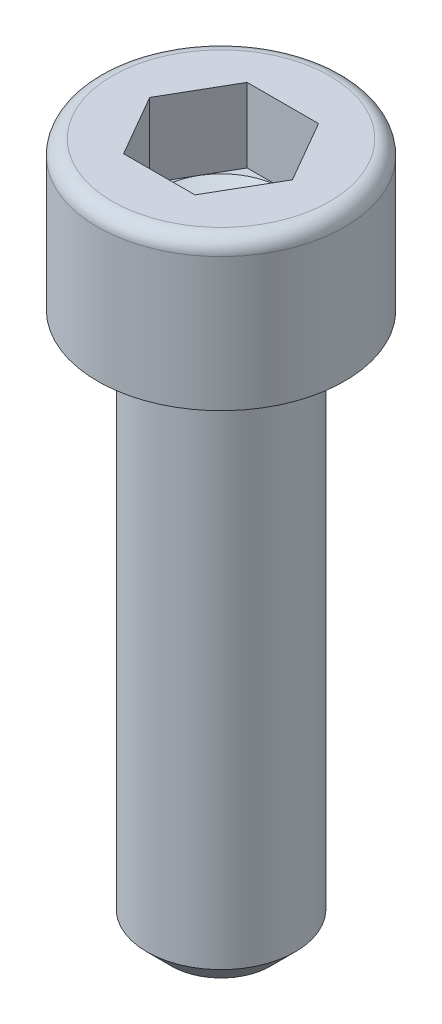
ISO-10303-21;
HEADER;
FILE_DESCRIPTION(('STEP AP214'),'2;1');
FILE_NAME('part.step','',(''),(''),'','','');
FILE_SCHEMA(('AUTOMOTIVE_DESIGN { 1 0 10303 214 1 1 1 1 }'));
ENDSEC;
DATA;
#1=APPLICATION_CONTEXT('core data for automotive mechanical design processes');
#2=APPLICATION_PROTOCOL_DEFINITION('international standard','automotive_design',2000,#1);
#3=PRODUCT_CONTEXT('',#1,'mechanical');
#4=PRODUCT('Part','Part','',(#3));
#5=PRODUCT_RELATED_PRODUCT_CATEGORY('part','',(#4));
#6=PRODUCT_DEFINITION_FORMATION('','',#4);
#7=PRODUCT_DEFINITION_CONTEXT('part definition',#1,'design');
#8=PRODUCT_DEFINITION('design','',#6,#7);
#9=PRODUCT_DEFINITION_SHAPE('','',#8);
#10=(LENGTH_UNIT() NAMED_UNIT(*) SI_UNIT(.MILLI.,.METRE.));
#11=(NAMED_UNIT(*) PLANE_ANGLE_UNIT() SI_UNIT($,.RADIAN.));
#12=(NAMED_UNIT(*) SI_UNIT($,.STERADIAN.) SOLID_ANGLE_UNIT());
#13=UNCERTAINTY_MEASURE_WITH_UNIT(LENGTH_MEASURE(1.E-05),#10,'distance_accuracy_value','');
#14=(GEOMETRIC_REPRESENTATION_CONTEXT(3) GLOBAL_UNCERTAINTY_ASSIGNED_CONTEXT((#13)) GLOBAL_UNIT_ASSIGNED_CONTEXT((#10,
#11,#12)) REPRESENTATION_CONTEXT('',''));
#15=CARTESIAN_POINT('',(0.,0.,0.));
#16=DIRECTION('',(0.,0.,1.));
#17=DIRECTION('',(1.,0.,0.));
#18=AXIS2_PLACEMENT_3D('',#15,#16,#17);
#19=CARTESIAN_POINT('',(-4.33012701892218,3.,2.5));
#20=DIRECTION('',(0.,-1.,0.));
#21=DIRECTION('',(0.,0.,-1.));
#22=AXIS2_PLACEMENT_3D('',#19,#20,#21);
#23=PLANE('',#22);
#24=DIRECTION('',(-0.499999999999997,0.,0.86602540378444));
#25=VECTOR('',#24,1.);
#26=CARTESIAN_POINT('',(2.1650635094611,3.,1.24999999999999));
#27=LINE('',#26,#25);
#28=CARTESIAN_POINT('',(2.16506350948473,2.99999999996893,1.25000000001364));
#29=VERTEX_POINT('',#28);
#30=CARTESIAN_POINT('',(1.44337567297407,3.,2.5));
#31=VERTEX_POINT('',#30);
#32=EDGE_CURVE('E102',#29,#31,#27,.T.);
#33=ORIENTED_EDGE('',*,*,#32,.F.);
#34=CARTESIAN_POINT('',(0.,2.99999999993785,0.));
#35=DIRECTION('',(0.,1.,0.));
#36=DIRECTION('',(0.,0.,1.));
#37=AXIS2_PLACEMENT_3D('',#34,#35,#36);
#38=CIRCLE('',#37,2.50000000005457);
#39=CARTESIAN_POINT('',(0.,2.99999999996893,2.50000000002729));
#40=VERTEX_POINT('',#39);
#41=EDGE_CURVE('E110',#29,#40,#38,.F.);
#42=ORIENTED_EDGE('',*,*,#41,.T.);
#43=DIRECTION('',(1.,0.,0.));
#44=VECTOR('',#43,1.);
#45=CARTESIAN_POINT('',(-4.33012701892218,3.,2.5));
#46=LINE('',#45,#44);
#47=EDGE_CURVE('E79',#31,#40,#46,.F.);
#48=ORIENTED_EDGE('',*,*,#47,.F.);
#49=EDGE_LOOP('',(#33,#42,#48));
#50=FACE_BOUND('',#49,.T.);
#51=ADVANCED_FACE('F16',(#50),#23,.F.);
#52=CARTESIAN_POINT('',(-4.33012701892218,3.,2.5));
#53=DIRECTION('',(0.,-1.,0.));
#54=DIRECTION('',(0.,0.,-1.));
#55=AXIS2_PLACEMENT_3D('',#52,#53,#54);
#56=PLANE('',#55);
#57=DIRECTION('',(1.,0.,0.));
#58=VECTOR('',#57,1.);
#59=CARTESIAN_POINT('',(-4.33012701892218,3.,2.5));
#60=LINE('',#59,#58);
#61=CARTESIAN_POINT('',(-1.44337567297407,3.,2.5));
#62=VERTEX_POINT('',#61);
#63=EDGE_CURVE('E261',#40,#62,#60,.F.);
#64=ORIENTED_EDGE('',*,*,#63,.F.);
#65=CARTESIAN_POINT('',(0.,2.99999999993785,0.));
#66=DIRECTION('',(0.,1.,0.));
#67=DIRECTION('',(0.,0.,1.));
#68=AXIS2_PLACEMENT_3D('',#65,#66,#67);
#69=CIRCLE('',#68,2.50000000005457);
#70=CARTESIAN_POINT('',(-2.16506350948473,2.99999999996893,1.25000000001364));
#71=VERTEX_POINT('',#70);
#72=EDGE_CURVE('E116',#40,#71,#69,.F.);
#73=ORIENTED_EDGE('',*,*,#72,.T.);
#74=DIRECTION('',(-0.499999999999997,0.,-0.86602540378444));
#75=VECTOR('',#74,1.);
#76=CARTESIAN_POINT('',(-1.44337567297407,3.,2.5));
#77=LINE('',#76,#75);
#78=EDGE_CURVE('E259',#62,#71,#77,.T.);
#79=ORIENTED_EDGE('',*,*,#78,.F.);
#80=EDGE_LOOP('',(#64,#73,#79));
#81=FACE_BOUND('',#80,.T.);
#82=ADVANCED_FACE('F263',(#81),#56,.F.);
#83=CARTESIAN_POINT('',(-4.33012701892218,3.,2.5));
#84=DIRECTION('',(0.,-1.,0.));
#85=DIRECTION('',(0.,0.,-1.));
#86=AXIS2_PLACEMENT_3D('',#83,#84,#85);
#87=PLANE('',#86);
#88=DIRECTION('',(1.,0.,0.));
#89=VECTOR('',#88,1.);
#90=CARTESIAN_POINT('',(-4.33012701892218,3.,-2.5));
#91=LINE('',#90,#89);
#92=CARTESIAN_POINT('',(0.,2.99999999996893,-2.50000000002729));
#93=VERTEX_POINT('',#92);
#94=CARTESIAN_POINT('',(1.44337567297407,3.,-2.5));
#95=VERTEX_POINT('',#94);
#96=EDGE_CURVE('E121',#93,#95,#91,.T.);
#97=ORIENTED_EDGE('',*,*,#96,.F.);
#98=CARTESIAN_POINT('',(0.,2.99999999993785,0.));
#99=DIRECTION('',(0.,1.,0.));
#100=DIRECTION('',(0.,0.,1.));
#101=AXIS2_PLACEMENT_3D('',#98,#99,#100);
#102=CIRCLE('',#101,2.50000000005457);
#103=CARTESIAN_POINT('',(2.16506350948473,2.99999999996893,-1.25000000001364));
#104=VERTEX_POINT('',#103);
#105=EDGE_CURVE('E96',#93,#104,#102,.F.);
#106=ORIENTED_EDGE('',*,*,#105,.T.);
#107=DIRECTION('',(0.499999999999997,0.,0.86602540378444));
#108=VECTOR('',#107,1.);
#109=CARTESIAN_POINT('',(1.44337567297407,3.,-2.5));
#110=LINE('',#109,#108);
#111=EDGE_CURVE('E117',#95,#104,#110,.T.);
#112=ORIENTED_EDGE('',*,*,#111,.F.);
#113=EDGE_LOOP('',(#97,#106,#112));
#114=FACE_BOUND('',#113,.T.);
#115=ADVANCED_FACE('F285',(#114),#87,.F.);
#116=CARTESIAN_POINT('',(0.,2.99999999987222,0.));
#117=DIRECTION('',(0.,1.,0.));
#118=DIRECTION('',(0.,0.,1.));
#119=AXIS2_PLACEMENT_3D('',#116,#117,#118);
#120=CONICAL_SURFACE('',#119,2.49999999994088,1.04719755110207);
#121=CARTESIAN_POINT('',(-7.105427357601E-11,1.55662432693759,0.));
#122=VERTEX_POINT('',#121);
#123=VERTEX_LOOP('',#122);
#124=FACE_BOUND('',#123,.T.);
#125=ORIENTED_EDGE('',*,*,#41,.F.);
#126=CARTESIAN_POINT('',(0.,2.99999999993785,0.));
#127=DIRECTION('',(0.,1.,0.));
#128=DIRECTION('',(0.,0.,1.));
#129=AXIS2_PLACEMENT_3D('',#126,#127,#128);
#130=CIRCLE('',#129,2.50000000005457);
#131=EDGE_CURVE('E85',#104,#29,#130,.F.);
#132=ORIENTED_EDGE('',*,*,#131,.F.);
#133=ORIENTED_EDGE('',*,*,#105,.F.);
#134=CARTESIAN_POINT('',(0.,2.99999999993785,0.));
#135=DIRECTION('',(0.,1.,0.));
#136=DIRECTION('',(0.,0.,1.));
#137=AXIS2_PLACEMENT_3D('',#134,#135,#136);
#138=CIRCLE('',#137,2.50000000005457);
#139=CARTESIAN_POINT('',(-2.16506350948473,2.99999999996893,-1.25000000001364));
#140=VERTEX_POINT('',#139);
#141=EDGE_CURVE('E95',#93,#140,#138,.T.);
#142=ORIENTED_EDGE('',*,*,#141,.T.);
#143=CARTESIAN_POINT('',(0.,2.99999999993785,0.));
#144=DIRECTION('',(0.,1.,0.));
#145=DIRECTION('',(0.,0.,1.));
#146=AXIS2_PLACEMENT_3D('',#143,#144,#145);
#147=CIRCLE('',#146,2.50000000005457);
#148=EDGE_CURVE('E119',#71,#140,#147,.F.);
#149=ORIENTED_EDGE('',*,*,#148,.F.);
#150=ORIENTED_EDGE('',*,*,#72,.F.);
#151=EDGE_LOOP('',(#125,#132,#133,#142,#149,#150));
#152=FACE_BOUND('',#151,.T.);
#153=ADVANCED_FACE('F114',(#124,#152),#120,.F.);
#154=CARTESIAN_POINT('',(-4.33012701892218,3.,2.5));
#155=DIRECTION('',(0.,-1.,0.));
#156=DIRECTION('',(0.,0.,-1.));
#157=AXIS2_PLACEMENT_3D('',#154,#155,#156);
#158=PLANE('',#157);
#159=DIRECTION('',(0.499999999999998,0.,-0.86602540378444));
#160=VECTOR('',#159,1.);
#161=CARTESIAN_POINT('',(-1.44337567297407,3.,-2.5));
#162=LINE('',#161,#160);
#163=CARTESIAN_POINT('',(-1.44337567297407,3.,-2.5));
#164=VERTEX_POINT('',#163);
#165=EDGE_CURVE('E203',#140,#164,#162,.T.);
#166=ORIENTED_EDGE('',*,*,#165,.F.);
#167=ORIENTED_EDGE('',*,*,#141,.F.);
#168=DIRECTION('',(1.,0.,0.));
#169=VECTOR('',#168,1.);
#170=CARTESIAN_POINT('',(1.44337567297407,3.,-2.5));
#171=LINE('',#170,#169);
#172=EDGE_CURVE('E204',#164,#93,#171,.T.);
#173=ORIENTED_EDGE('',*,*,#172,.F.);
#174=EDGE_LOOP('',(#166,#167,#173));
#175=FACE_BOUND('',#174,.T.);
#176=ADVANCED_FACE('F245',(#175),#158,.F.);
#177=CARTESIAN_POINT('',(-4.33012701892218,3.,2.5));
#178=DIRECTION('',(0.,-1.,0.));
#179=DIRECTION('',(0.,0.,-1.));
#180=AXIS2_PLACEMENT_3D('',#177,#178,#179);
#181=PLANE('',#180);
#182=DIRECTION('',(-0.499999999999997,0.,-0.86602540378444));
#183=VECTOR('',#182,1.);
#184=CARTESIAN_POINT('',(-1.44337567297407,3.,2.5));
#185=LINE('',#184,#183);
#186=CARTESIAN_POINT('',(-2.88675134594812,3.,0.));
#187=VERTEX_POINT('',#186);
#188=EDGE_CURVE('E189',#71,#187,#185,.T.);
#189=ORIENTED_EDGE('',*,*,#188,.F.);
#190=ORIENTED_EDGE('',*,*,#148,.T.);
#191=DIRECTION('',(0.499999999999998,0.,-0.86602540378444));
#192=VECTOR('',#191,1.);
#193=CARTESIAN_POINT('',(-1.44337567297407,3.,-2.5));
#194=LINE('',#193,#192);
#195=EDGE_CURVE('E200',#187,#140,#194,.T.);
#196=ORIENTED_EDGE('',*,*,#195,.F.);
#197=EDGE_LOOP('',(#189,#190,#196));
#198=FACE_BOUND('',#197,.T.);
#199=ADVANCED_FACE('F239',(#198),#181,.F.);
#200=CARTESIAN_POINT('',(-4.33012701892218,3.,2.5));
#201=DIRECTION('',(0.,-1.,0.));
#202=DIRECTION('',(0.,0.,-1.));
#203=AXIS2_PLACEMENT_3D('',#200,#201,#202);
#204=PLANE('',#203);
#205=DIRECTION('',(0.499999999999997,0.,0.86602540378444));
#206=VECTOR('',#205,1.);
#207=CARTESIAN_POINT('',(1.44337567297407,3.,-2.5));
#208=LINE('',#207,#206);
#209=CARTESIAN_POINT('',(2.88675134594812,3.,0.));
#210=VERTEX_POINT('',#209);
#211=EDGE_CURVE('E91',#104,#210,#208,.T.);
#212=ORIENTED_EDGE('',*,*,#211,.F.);
#213=ORIENTED_EDGE('',*,*,#131,.T.);
#214=DIRECTION('',(-0.499999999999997,0.,0.86602540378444));
#215=VECTOR('',#214,1.);
#216=CARTESIAN_POINT('',(1.44337567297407,3.,2.5));
#217=LINE('',#216,#215);
#218=EDGE_CURVE('E88',#210,#29,#217,.T.);
#219=ORIENTED_EDGE('',*,*,#218,.F.);
#220=EDGE_LOOP('',(#212,#213,#219));
#221=FACE_BOUND('',#220,.T.);
#222=ADVANCED_FACE('F87',(#221),#204,.F.);
#223=CARTESIAN_POINT('',(1.44337567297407,3.,-2.5));
#224=DIRECTION('',(0.,0.,1.));
#225=DIRECTION('',(1.,0.,0.));
#226=AXIS2_PLACEMENT_3D('',#223,#224,#225);
#227=PLANE('',#226);
#228=ORIENTED_EDGE('',*,*,#96,.T.);
#229=DIRECTION('',(0.,1.,0.));
#230=VECTOR('',#229,1.);
#231=CARTESIAN_POINT('',(1.44337567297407,3.,-2.5));
#232=LINE('',#231,#230);
#233=CARTESIAN_POINT('',(1.44337567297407,6.,-2.5));
#234=VERTEX_POINT('',#233);
#235=EDGE_CURVE('E181',#234,#95,#232,.F.);
#236=ORIENTED_EDGE('',*,*,#235,.F.);
#237=DIRECTION('',(1.,0.,0.));
#238=VECTOR('',#237,1.);
#239=CARTESIAN_POINT('',(2.5,6.,-2.5));
#240=LINE('',#239,#238);
#241=CARTESIAN_POINT('',(-1.44337567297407,6.,-2.5));
#242=VERTEX_POINT('',#241);
#243=EDGE_CURVE('E165',#234,#242,#240,.F.);
#244=ORIENTED_EDGE('',*,*,#243,.T.);
#245=DIRECTION('',(0.,1.,0.));
#246=VECTOR('',#245,1.);
#247=CARTESIAN_POINT('',(-1.44337567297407,3.,-2.5));
#248=LINE('',#247,#246);
#249=EDGE_CURVE('E193',#164,#242,#248,.T.);
#250=ORIENTED_EDGE('',*,*,#249,.F.);
#251=ORIENTED_EDGE('',*,*,#172,.T.);
#252=EDGE_LOOP('',(#228,#236,#244,#250,#251));
#253=FACE_BOUND('',#252,.T.);
#254=ADVANCED_FACE('F277',(#253),#227,.T.);
#255=CARTESIAN_POINT('',(-1.44337567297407,3.,-2.5));
#256=DIRECTION('',(0.86602540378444,0.,0.499999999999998));
#257=DIRECTION('',(0.499999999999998,0.,-0.86602540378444));
#258=AXIS2_PLACEMENT_3D('',#255,#256,#257);
#259=PLANE('',#258);
#260=ORIENTED_EDGE('',*,*,#165,.T.);
#261=ORIENTED_EDGE('',*,*,#249,.T.);
#262=DIRECTION('',(-0.499999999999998,0.,0.86602540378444));
#263=VECTOR('',#262,1.);
#264=CARTESIAN_POINT('',(-1.44337567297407,6.,-2.5));
#265=LINE('',#264,#263);
#266=CARTESIAN_POINT('',(-2.88675134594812,6.,0.));
#267=VERTEX_POINT('',#266);
#268=EDGE_CURVE('E252',#242,#267,#265,.T.);
#269=ORIENTED_EDGE('',*,*,#268,.T.);
#270=DIRECTION('',(0.,1.,0.));
#271=VECTOR('',#270,1.);
#272=CARTESIAN_POINT('',(-2.88675134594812,3.,0.));
#273=LINE('',#272,#271);
#274=EDGE_CURVE('E192',#187,#267,#273,.T.);
#275=ORIENTED_EDGE('',*,*,#274,.F.);
#276=ORIENTED_EDGE('',*,*,#195,.T.);
#277=EDGE_LOOP('',(#260,#261,#269,#275,#276));
#278=FACE_BOUND('',#277,.T.);
#279=ADVANCED_FACE('F248',(#278),#259,.T.);
#280=CARTESIAN_POINT('',(-1.44337567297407,3.,2.5));
#281=DIRECTION('',(0.86602540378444,0.,-0.499999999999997));
#282=DIRECTION('',(-0.499999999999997,0.,-0.86602540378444));
#283=AXIS2_PLACEMENT_3D('',#280,#281,#282);
#284=PLANE('',#283);
#285=ORIENTED_EDGE('',*,*,#188,.T.);
#286=ORIENTED_EDGE('',*,*,#274,.T.);
#287=DIRECTION('',(0.499999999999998,0.,0.86602540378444));
#288=VECTOR('',#287,1.);
#289=CARTESIAN_POINT('',(-2.88675134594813,6.,0.));
#290=LINE('',#289,#288);
#291=CARTESIAN_POINT('',(-1.44337567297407,6.,2.5));
#292=VERTEX_POINT('',#291);
#293=EDGE_CURVE('E434',#267,#292,#290,.T.);
#294=ORIENTED_EDGE('',*,*,#293,.T.);
#295=DIRECTION('',(0.,1.,0.));
#296=VECTOR('',#295,1.);
#297=CARTESIAN_POINT('',(-1.44337567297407,3.,2.5));
#298=LINE('',#297,#296);
#299=EDGE_CURVE('E107',#62,#292,#298,.T.);
#300=ORIENTED_EDGE('',*,*,#299,.F.);
#301=ORIENTED_EDGE('',*,*,#78,.T.);
#302=EDGE_LOOP('',(#285,#286,#294,#300,#301));
#303=FACE_BOUND('',#302,.T.);
#304=ADVANCED_FACE('F256',(#303),#284,.T.);
#305=CARTESIAN_POINT('',(1.44337567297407,3.,2.5));
#306=DIRECTION('',(0.,0.,-1.));
#307=DIRECTION('',(-1.,0.,0.));
#308=AXIS2_PLACEMENT_3D('',#305,#306,#307);
#309=PLANE('',#308);
#310=ORIENTED_EDGE('',*,*,#63,.T.);
#311=ORIENTED_EDGE('',*,*,#299,.T.);
#312=DIRECTION('',(1.,0.,0.));
#313=VECTOR('',#312,1.);
#314=CARTESIAN_POINT('',(2.5,6.,2.5));
#315=LINE('',#314,#313);
#316=CARTESIAN_POINT('',(1.44337567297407,6.,2.5));
#317=VERTEX_POINT('',#316);
#318=EDGE_CURVE('E435',#292,#317,#315,.T.);
#319=ORIENTED_EDGE('',*,*,#318,.T.);
#320=DIRECTION('',(0.,1.,0.));
#321=VECTOR('',#320,1.);
#322=CARTESIAN_POINT('',(1.44337567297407,3.,2.5));
#323=LINE('',#322,#321);
#324=EDGE_CURVE('E106',#31,#317,#323,.T.);
#325=ORIENTED_EDGE('',*,*,#324,.F.);
#326=ORIENTED_EDGE('',*,*,#47,.T.);
#327=EDGE_LOOP('',(#310,#311,#319,#325,#326));
#328=FACE_BOUND('',#327,.T.);
#329=ADVANCED_FACE('F362',(#328),#309,.T.);
#330=CARTESIAN_POINT('',(1.44337567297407,3.,2.5));
#331=DIRECTION('',(-0.86602540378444,0.,-0.499999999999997));
#332=DIRECTION('',(-0.499999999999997,0.,0.86602540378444));
#333=AXIS2_PLACEMENT_3D('',#330,#331,#332);
#334=PLANE('',#333);
#335=ORIENTED_EDGE('',*,*,#32,.T.);
#336=ORIENTED_EDGE('',*,*,#324,.T.);
#337=DIRECTION('',(0.499999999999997,0.,-0.86602540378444));
#338=VECTOR('',#337,1.);
#339=CARTESIAN_POINT('',(1.44337567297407,6.,2.5));
#340=LINE('',#339,#338);
#341=CARTESIAN_POINT('',(2.88675134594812,6.,0.));
#342=VERTEX_POINT('',#341);
#343=EDGE_CURVE('E438',#317,#342,#340,.T.);
#344=ORIENTED_EDGE('',*,*,#343,.T.);
#345=DIRECTION('',(0.,1.,0.));
#346=VECTOR('',#345,1.);
#347=CARTESIAN_POINT('',(2.88675134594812,3.,0.));
#348=LINE('',#347,#346);
#349=EDGE_CURVE('E105',#210,#342,#348,.T.);
#350=ORIENTED_EDGE('',*,*,#349,.F.);
#351=ORIENTED_EDGE('',*,*,#218,.T.);
#352=EDGE_LOOP('',(#335,#336,#344,#350,#351));
#353=FACE_BOUND('',#352,.T.);
#354=ADVANCED_FACE('F100',(#353),#334,.T.);
#355=CARTESIAN_POINT('',(1.44337567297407,3.,-2.5));
#356=DIRECTION('',(-0.86602540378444,0.,0.499999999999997));
#357=DIRECTION('',(0.499999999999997,0.,0.86602540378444));
#358=AXIS2_PLACEMENT_3D('',#355,#356,#357);
#359=PLANE('',#358);
#360=ORIENTED_EDGE('',*,*,#211,.T.);
#361=ORIENTED_EDGE('',*,*,#349,.T.);
#362=DIRECTION('',(-0.499999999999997,0.,-0.86602540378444));
#363=VECTOR('',#362,1.);
#364=CARTESIAN_POINT('',(2.88675134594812,6.,0.));
#365=LINE('',#364,#363);
#366=EDGE_CURVE('E129',#342,#234,#365,.T.);
#367=ORIENTED_EDGE('',*,*,#366,.T.);
#368=ORIENTED_EDGE('',*,*,#235,.T.);
#369=ORIENTED_EDGE('',*,*,#111,.T.);
#370=EDGE_LOOP('',(#360,#361,#367,#368,#369));
#371=FACE_BOUND('',#370,.T.);
#372=ADVANCED_FACE('F150',(#371),#359,.T.);
#373=CARTESIAN_POINT('',(2.5,6.,0.));
#374=DIRECTION('',(0.,-1.,0.));
#375=DIRECTION('',(1.,0.,0.));
#376=AXIS2_PLACEMENT_3D('',#373,#374,#375);
#377=PLANE('',#376);
#378=ORIENTED_EDGE('',*,*,#343,.F.);
#379=ORIENTED_EDGE('',*,*,#318,.F.);
#380=ORIENTED_EDGE('',*,*,#293,.F.);
#381=ORIENTED_EDGE('',*,*,#268,.F.);
#382=ORIENTED_EDGE('',*,*,#243,.F.);
#383=ORIENTED_EDGE('',*,*,#366,.F.);
#384=EDGE_LOOP('',(#378,#379,#380,#381,#382,#383));
#385=FACE_BOUND('',#384,.T.);
#386=CARTESIAN_POINT('',(0.,6.,0.));
#387=DIRECTION('',(0.,-1.,0.));
#388=DIRECTION('',(-1.,0.,0.));
#389=AXIS2_PLACEMENT_3D('',#386,#387,#388);
#390=CIRCLE('',#389,4.4);
#391=CARTESIAN_POINT('',(-4.4,6.,0.));
#392=VERTEX_POINT('',#391);
#393=CARTESIAN_POINT('',(4.4,6.,0.));
#394=VERTEX_POINT('',#393);
#395=EDGE_CURVE('E36',#392,#394,#390,.T.);
#396=ORIENTED_EDGE('',*,*,#395,.F.);
#397=CARTESIAN_POINT('',(0.,6.,0.));
#398=DIRECTION('',(0.,-1.,0.));
#399=DIRECTION('',(1.,0.,0.));
#400=AXIS2_PLACEMENT_3D('',#397,#398,#399);
#401=CIRCLE('',#400,4.4);
#402=EDGE_CURVE('E127',#394,#392,#401,.T.);
#403=ORIENTED_EDGE('',*,*,#402,.F.);
#404=EDGE_LOOP('',(#396,#403));
#405=FACE_BOUND('',#404,.T.);
#406=ADVANCED_FACE('F131',(#385,#405),#377,.F.);
#407=CARTESIAN_POINT('',(0.,5.4,0.));
#408=DIRECTION('',(0.,1.,0.));
#409=DIRECTION('',(-1.,0.,0.));
#410=AXIS2_PLACEMENT_3D('',#407,#408,#409);
#411=TOROIDAL_SURFACE('',#410,4.4,0.6);
#412=ORIENTED_EDGE('',*,*,#395,.T.);
#413=ORIENTED_EDGE('',*,*,#402,.T.);
#414=EDGE_LOOP('',(#412,#413));
#415=FACE_BOUND('',#414,.T.);
#416=CARTESIAN_POINT('',(0.,5.4,0.));
#417=DIRECTION('',(0.,1.,0.));
#418=DIRECTION('',(-1.,0.,0.));
#419=AXIS2_PLACEMENT_3D('',#416,#417,#418);
#420=CIRCLE('',#419,5.);
#421=CARTESIAN_POINT('',(-5.,5.4,0.));
#422=VERTEX_POINT('',#421);
#423=EDGE_CURVE('E132',#422,#422,#420,.F.);
#424=ORIENTED_EDGE('',*,*,#423,.F.);
#425=EDGE_LOOP('',(#424));
#426=FACE_BOUND('',#425,.T.);
#427=ADVANCED_FACE('F125',(#415,#426),#411,.T.);
#428=CARTESIAN_POINT('',(0.,-22.,0.));
#429=DIRECTION('',(0.,1.,0.));
#430=DIRECTION('',(0.,0.,1.));
#431=AXIS2_PLACEMENT_3D('',#428,#429,#430);
#432=PLANE('',#431);
#433=CARTESIAN_POINT('',(0.,-21.9999999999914,0.));
#434=DIRECTION('',(0.,1.,0.));
#435=DIRECTION('',(0.,0.,1.));
#436=AXIS2_PLACEMENT_3D('',#433,#434,#435);
#437=CIRCLE('',#436,1.99999999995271);
#438=CARTESIAN_POINT('',(0.,-21.9999999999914,1.99999999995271));
#439=VERTEX_POINT('',#438);
#440=EDGE_CURVE('E171',#439,#439,#437,.T.);
#441=ORIENTED_EDGE('',*,*,#440,.F.);
#442=EDGE_LOOP('',(#441));
#443=FACE_BOUND('',#442,.T.);
#444=ADVANCED_FACE('F158',(#443),#432,.F.);
#445=CARTESIAN_POINT('',(0.,6.,0.));
#446=DIRECTION('',(0.,1.,0.));
#447=DIRECTION('',(-1.,0.,0.));
#448=AXIS2_PLACEMENT_3D('',#445,#446,#447);
#449=CYLINDRICAL_SURFACE('',#448,5.);
#450=ORIENTED_EDGE('',*,*,#423,.T.);
#451=EDGE_LOOP('',(#450));
#452=FACE_BOUND('',#451,.T.);
#453=CARTESIAN_POINT('',(0.,0.,0.));
#454=DIRECTION('',(0.,1.,0.));
#455=DIRECTION('',(-1.,0.,0.));
#456=AXIS2_PLACEMENT_3D('',#453,#454,#455);
#457=CIRCLE('',#456,5.);
#458=CARTESIAN_POINT('',(-5.,0.,0.));
#459=VERTEX_POINT('',#458);
#460=EDGE_CURVE('E169',#459,#459,#457,.T.);
#461=ORIENTED_EDGE('',*,*,#460,.T.);
#462=EDGE_LOOP('',(#461));
#463=FACE_BOUND('',#462,.T.);
#464=ADVANCED_FACE('F310',(#452,#463),#449,.T.);
#465=CARTESIAN_POINT('',(0.,-21.000000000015,0.));
#466=DIRECTION('',(0.,1.,0.));
#467=DIRECTION('',(0.,0.,1.));
#468=AXIS2_PLACEMENT_3D('',#465,#466,#467);
#469=CONICAL_SURFACE('',#468,2.99999999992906,0.785398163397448);
#470=CARTESIAN_POINT('',(0.,-21.,0.));
#471=DIRECTION('',(0.,1.,0.));
#472=DIRECTION('',(0.,0.,1.));
#473=AXIS2_PLACEMENT_3D('',#470,#471,#472);
#474=CIRCLE('',#473,3.);
#475=CARTESIAN_POINT('',(0.,-21.,3.));
#476=VERTEX_POINT('',#475);
#477=EDGE_CURVE('E28',#476,#476,#474,.T.);
#478=ORIENTED_EDGE('',*,*,#477,.F.);
#479=EDGE_LOOP('',(#478));
#480=FACE_BOUND('',#479,.T.);
#481=ORIENTED_EDGE('',*,*,#440,.T.);
#482=EDGE_LOOP('',(#481));
#483=FACE_BOUND('',#482,.T.);
#484=ADVANCED_FACE('F302',(#480,#483),#469,.T.);
#485=CARTESIAN_POINT('',(0.,0.,0.));
#486=DIRECTION('',(0.,1.,0.));
#487=DIRECTION('',(-1.,0.,0.));
#488=AXIS2_PLACEMENT_3D('',#485,#486,#487);
#489=PLANE('',#488);
#490=ORIENTED_EDGE('',*,*,#460,.F.);
#491=EDGE_LOOP('',(#490));
#492=FACE_BOUND('',#491,.T.);
#493=CARTESIAN_POINT('',(0.,0.,0.));
#494=DIRECTION('',(0.,1.,0.));
#495=DIRECTION('',(0.,0.,1.));
#496=AXIS2_PLACEMENT_3D('',#493,#494,#495);
#497=CIRCLE('',#496,3.);
#498=CARTESIAN_POINT('',(0.,0.,3.));
#499=VERTEX_POINT('',#498);
#500=EDGE_CURVE('E10',#499,#499,#497,.F.);
#501=ORIENTED_EDGE('',*,*,#500,.F.);
#502=EDGE_LOOP('',(#501));
#503=FACE_BOUND('',#502,.T.);
#504=ADVANCED_FACE('F297',(#492,#503),#489,.F.);
#505=CARTESIAN_POINT('',(0.,-22.,0.));
#506=DIRECTION('',(0.,1.,0.));
#507=DIRECTION('',(0.,0.,1.));
#508=AXIS2_PLACEMENT_3D('',#505,#506,#507);
#509=CYLINDRICAL_SURFACE('',#508,3.);
#510=ORIENTED_EDGE('',*,*,#500,.T.);
#511=EDGE_LOOP('',(#510));
#512=FACE_BOUND('',#511,.T.);
#513=ORIENTED_EDGE('',*,*,#477,.T.);
#514=EDGE_LOOP('',(#513));
#515=FACE_BOUND('',#514,.T.);
#516=ADVANCED_FACE('F18',(#512,#515),#509,.T.);
#517=CLOSED_SHELL('',(#51,#82,#115,#153,#176,#199,#222,#254,#279,#304,#329,#354,#372,#406,#427,
#444,#464,#484,#504,#516));
#518=MANIFOLD_SOLID_BREP('B1',#517);
#519=ADVANCED_BREP_SHAPE_REPRESENTATION('',(#18,#518),#14);
#520=SHAPE_DEFINITION_REPRESENTATION(#9,#519);
ENDSEC;
END-ISO-10303-21;
